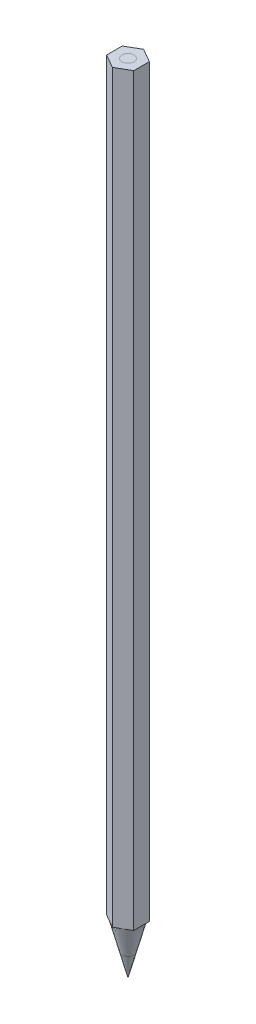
ISO-10303-21;
HEADER;
FILE_DESCRIPTION(('STEP AP214'),'2;1');
FILE_NAME('part.step','',(''),(''),'','','');
FILE_SCHEMA(('AUTOMOTIVE_DESIGN { 1 0 10303 214 1 1 1 1 }'));
ENDSEC;
DATA;
#1=APPLICATION_CONTEXT('core data for automotive mechanical design processes');
#2=APPLICATION_PROTOCOL_DEFINITION('international standard','automotive_design',2000,#1);
#3=PRODUCT_CONTEXT('',#1,'mechanical');
#4=PRODUCT('Part','Part','',(#3));
#5=PRODUCT_RELATED_PRODUCT_CATEGORY('part','',(#4));
#6=PRODUCT_DEFINITION_FORMATION('','',#4);
#7=PRODUCT_DEFINITION_CONTEXT('part definition',#1,'design');
#8=PRODUCT_DEFINITION('design','',#6,#7);
#9=PRODUCT_DEFINITION_SHAPE('','',#8);
#10=(LENGTH_UNIT() NAMED_UNIT(*) SI_UNIT(.MILLI.,.METRE.));
#11=(NAMED_UNIT(*) PLANE_ANGLE_UNIT() SI_UNIT($,.RADIAN.));
#12=(NAMED_UNIT(*) SI_UNIT($,.STERADIAN.) SOLID_ANGLE_UNIT());
#13=UNCERTAINTY_MEASURE_WITH_UNIT(LENGTH_MEASURE(1.E-05),#10,'distance_accuracy_value','');
#14=(GEOMETRIC_REPRESENTATION_CONTEXT(3) GLOBAL_UNCERTAINTY_ASSIGNED_CONTEXT((#13)) GLOBAL_UNIT_ASSIGNED_CONTEXT((#10,
#11,#12)) REPRESENTATION_CONTEXT('',''));
#15=CARTESIAN_POINT('',(0.,0.,0.));
#16=DIRECTION('',(0.,0.,1.));
#17=DIRECTION('',(1.,0.,0.));
#18=AXIS2_PLACEMENT_3D('',#15,#16,#17);
#19=CARTESIAN_POINT('',(0.,200.,0.));
#20=DIRECTION('',(0.,-1.,0.));
#21=DIRECTION('',(0.,0.,-1.));
#22=AXIS2_PLACEMENT_3D('',#19,#20,#21);
#23=CYLINDRICAL_SURFACE('',#22,1.5);
#24=CARTESIAN_POINT('',(0.,5.7389647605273,0.));
#25=DIRECTION('',(0.,1.,0.));
#26=DIRECTION('',(0.,0.,1.));
#27=AXIS2_PLACEMENT_3D('',#24,#25,#26);
#28=CIRCLE('',#27,1.5);
#29=CARTESIAN_POINT('',(0.,5.7389647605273,1.5));
#30=VERTEX_POINT('',#29);
#31=EDGE_CURVE('E44',#30,#30,#28,.T.);
#32=ORIENTED_EDGE('',*,*,#31,.T.);
#33=EDGE_LOOP('',(#32));
#34=FACE_BOUND('',#33,.T.);
#35=CARTESIAN_POINT('',(0.,200.,0.));
#36=DIRECTION('',(0.,1.,0.));
#37=DIRECTION('',(0.,0.,1.));
#38=AXIS2_PLACEMENT_3D('',#35,#36,#37);
#39=CIRCLE('',#38,1.5);
#40=CARTESIAN_POINT('',(0.,200.,1.5));
#41=VERTEX_POINT('',#40);
#42=EDGE_CURVE('E12',#41,#41,#39,.T.);
#43=ORIENTED_EDGE('',*,*,#42,.F.);
#44=EDGE_LOOP('',(#43));
#45=FACE_BOUND('',#44,.T.);
#46=ADVANCED_FACE('F41',(#34,#45),#23,.T.);
#47=CARTESIAN_POINT('',(0.,200.,0.));
#48=DIRECTION('',(0.,1.,0.));
#49=DIRECTION('',(0.,0.,1.));
#50=AXIS2_PLACEMENT_3D('',#47,#48,#49);
#51=PLANE('',#50);
#52=ORIENTED_EDGE('',*,*,#42,.T.);
#53=EDGE_LOOP('',(#52));
#54=FACE_BOUND('',#53,.T.);
#55=ADVANCED_FACE('F53',(#54),#51,.T.);
#56=CARTESIAN_POINT('',(0.,13.0083201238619,0.));
#57=DIRECTION('',(0.,1.,0.));
#58=DIRECTION('',(0.,0.,1.));
#59=AXIS2_PLACEMENT_3D('',#56,#57,#58);
#60=CONICAL_SURFACE('',#59,3.4,0.255651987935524);
#61=CARTESIAN_POINT('',(0.,0.,0.));
#62=VERTEX_POINT('',#61);
#63=VERTEX_LOOP('',#62);
#64=FACE_BOUND('',#63,.T.);
#65=ORIENTED_EDGE('',*,*,#31,.F.);
#66=EDGE_LOOP('',(#65));
#67=FACE_BOUND('',#66,.T.);
#68=ADVANCED_FACE('F50',(#64,#67),#60,.T.);
#69=CLOSED_SHELL('',(#46,#55,#68));
#70=MANIFOLD_SOLID_BREP('B2',#69);
#71=CARTESIAN_POINT('',(0.,200.,-3.92598183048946));
#72=DIRECTION('',(0.,1.,0.));
#73=DIRECTION('',(0.,0.,1.));
#74=AXIS2_PLACEMENT_3D('',#71,#72,#73);
#75=PLANE('',#74);
#76=DIRECTION('',(-0.866025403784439,0.,-0.5));
#77=VECTOR('',#76,1.);
#78=CARTESIAN_POINT('',(3.4,200.,-1.96299091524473));
#79=LINE('',#78,#77);
#80=CARTESIAN_POINT('',(3.4,200.,-1.96299091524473));
#81=VERTEX_POINT('',#80);
#82=CARTESIAN_POINT('',(0.,200.,-3.92598183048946));
#83=VERTEX_POINT('',#82);
#84=EDGE_CURVE('E186',#81,#83,#79,.T.);
#85=ORIENTED_EDGE('',*,*,#84,.T.);
#86=DIRECTION('',(-0.866025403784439,0.,0.5));
#87=VECTOR('',#86,1.);
#88=CARTESIAN_POINT('',(0.,200.,-3.92598183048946));
#89=LINE('',#88,#87);
#90=CARTESIAN_POINT('',(-3.4,200.,-1.96299091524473));
#91=VERTEX_POINT('',#90);
#92=EDGE_CURVE('E193',#83,#91,#89,.T.);
#93=ORIENTED_EDGE('',*,*,#92,.T.);
#94=DIRECTION('',(0.,0.,1.));
#95=VECTOR('',#94,1.);
#96=CARTESIAN_POINT('',(-3.4,200.,-1.96299091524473));
#97=LINE('',#96,#95);
#98=CARTESIAN_POINT('',(-3.4,200.,1.96299091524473));
#99=VERTEX_POINT('',#98);
#100=EDGE_CURVE('E195',#91,#99,#97,.T.);
#101=ORIENTED_EDGE('',*,*,#100,.T.);
#102=DIRECTION('',(0.866025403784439,0.,0.5));
#103=VECTOR('',#102,1.);
#104=CARTESIAN_POINT('',(-3.4,200.,1.96299091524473));
#105=LINE('',#104,#103);
#106=CARTESIAN_POINT('',(0.,200.,3.92598183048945));
#107=VERTEX_POINT('',#106);
#108=EDGE_CURVE('E197',#99,#107,#105,.T.);
#109=ORIENTED_EDGE('',*,*,#108,.T.);
#110=DIRECTION('',(0.866025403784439,0.,-0.499999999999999));
#111=VECTOR('',#110,1.);
#112=CARTESIAN_POINT('',(0.,200.,3.92598183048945));
#113=LINE('',#112,#111);
#114=CARTESIAN_POINT('',(3.4,200.,1.96299091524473));
#115=VERTEX_POINT('',#114);
#116=EDGE_CURVE('E199',#107,#115,#113,.T.);
#117=ORIENTED_EDGE('',*,*,#116,.T.);
#118=DIRECTION('',(0.,0.,-1.));
#119=VECTOR('',#118,1.);
#120=CARTESIAN_POINT('',(3.4,200.,1.96299091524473));
#121=LINE('',#120,#119);
#122=EDGE_CURVE('E107',#115,#81,#121,.T.);
#123=ORIENTED_EDGE('',*,*,#122,.T.);
#124=EDGE_LOOP('',(#85,#93,#101,#109,#117,#123));
#125=FACE_BOUND('',#124,.T.);
#126=CARTESIAN_POINT('',(0.,200.,0.));
#127=DIRECTION('',(0.,1.,0.));
#128=DIRECTION('',(0.,0.,1.));
#129=AXIS2_PLACEMENT_3D('',#126,#127,#128);
#130=CIRCLE('',#129,1.5);
#131=CARTESIAN_POINT('',(0.,200.,1.5));
#132=VERTEX_POINT('',#131);
#133=EDGE_CURVE('E184',#132,#132,#130,.T.);
#134=ORIENTED_EDGE('',*,*,#133,.F.);
#135=EDGE_LOOP('',(#134));
#136=FACE_BOUND('',#135,.T.);
#137=ADVANCED_FACE('F84',(#125,#136),#75,.T.);
#138=CARTESIAN_POINT('',(3.4,200.,-1.96299091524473));
#139=DIRECTION('',(-0.5,0.,0.866025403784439));
#140=DIRECTION('',(0.866025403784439,0.,0.5));
#141=AXIS2_PLACEMENT_3D('',#138,#139,#140);
#142=PLANE('',#141);
#143=DIRECTION('',(0.,-1.,0.));
#144=VECTOR('',#143,1.);
#145=CARTESIAN_POINT('',(3.4,200.,-1.96299091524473));
#146=LINE('',#145,#144);
#147=CARTESIAN_POINT('',(3.4,13.0083201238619,-1.96299091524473));
#148=VERTEX_POINT('',#147);
#149=EDGE_CURVE('E183',#81,#148,#146,.T.);
#150=ORIENTED_EDGE('',*,*,#149,.T.);
#151=DIRECTION('',(-0.866025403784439,0.,-0.5));
#152=VECTOR('',#151,1.);
#153=CARTESIAN_POINT('',(3.4,13.0083201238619,-1.96299091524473));
#154=LINE('',#153,#152);
#155=CARTESIAN_POINT('',(1.7,13.0083201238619,-2.94448637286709));
#156=VERTEX_POINT('',#155);
#157=EDGE_CURVE('E99',#148,#156,#154,.T.);
#158=ORIENTED_EDGE('',*,*,#157,.T.);
#159=CARTESIAN_POINT('',(0.,13.0083201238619,-3.92598183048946));
#160=VERTEX_POINT('',#159);
#161=EDGE_CURVE('E157',#156,#160,#154,.T.);
#162=ORIENTED_EDGE('',*,*,#161,.T.);
#163=DIRECTION('',(0.,-1.,0.));
#164=VECTOR('',#163,1.);
#165=CARTESIAN_POINT('',(0.,200.,-3.92598183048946));
#166=LINE('',#165,#164);
#167=EDGE_CURVE('E215',#83,#160,#166,.T.);
#168=ORIENTED_EDGE('',*,*,#167,.F.);
#169=ORIENTED_EDGE('',*,*,#84,.F.);
#170=EDGE_LOOP('',(#150,#158,#162,#168,#169));
#171=FACE_BOUND('',#170,.T.);
#172=ADVANCED_FACE('F86',(#171),#142,.F.);
#173=CARTESIAN_POINT('',(0.,200.,-3.92598183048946));
#174=DIRECTION('',(0.5,0.,0.866025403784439));
#175=DIRECTION('',(0.866025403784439,0.,-0.5));
#176=AXIS2_PLACEMENT_3D('',#173,#174,#175);
#177=PLANE('',#176);
#178=ORIENTED_EDGE('',*,*,#167,.T.);
#179=DIRECTION('',(-0.866025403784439,0.,0.5));
#180=VECTOR('',#179,1.);
#181=CARTESIAN_POINT('',(0.,13.0083201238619,-3.92598183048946));
#182=LINE('',#181,#180);
#183=CARTESIAN_POINT('',(-1.7,13.0083201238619,-2.94448637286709));
#184=VERTEX_POINT('',#183);
#185=EDGE_CURVE('E163',#160,#184,#182,.T.);
#186=ORIENTED_EDGE('',*,*,#185,.T.);
#187=CARTESIAN_POINT('',(-3.4,13.0083201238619,-1.96299091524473));
#188=VERTEX_POINT('',#187);
#189=EDGE_CURVE('E189',#184,#188,#182,.T.);
#190=ORIENTED_EDGE('',*,*,#189,.T.);
#191=DIRECTION('',(0.,-1.,0.));
#192=VECTOR('',#191,1.);
#193=CARTESIAN_POINT('',(-3.4,200.,-1.96299091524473));
#194=LINE('',#193,#192);
#195=EDGE_CURVE('E212',#91,#188,#194,.T.);
#196=ORIENTED_EDGE('',*,*,#195,.F.);
#197=ORIENTED_EDGE('',*,*,#92,.F.);
#198=EDGE_LOOP('',(#178,#186,#190,#196,#197));
#199=FACE_BOUND('',#198,.T.);
#200=ADVANCED_FACE('F257',(#199),#177,.F.);
#201=CARTESIAN_POINT('',(-3.4,200.,-1.96299091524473));
#202=DIRECTION('',(1.,0.,0.));
#203=DIRECTION('',(0.,0.,-1.));
#204=AXIS2_PLACEMENT_3D('',#201,#202,#203);
#205=PLANE('',#204);
#206=ORIENTED_EDGE('',*,*,#195,.T.);
#207=DIRECTION('',(0.,0.,1.));
#208=VECTOR('',#207,1.);
#209=CARTESIAN_POINT('',(-3.4,13.0083201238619,-1.96299091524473));
#210=LINE('',#209,#208);
#211=CARTESIAN_POINT('',(-3.4,13.0083201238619,0.));
#212=VERTEX_POINT('',#211);
#213=EDGE_CURVE('E232',#188,#212,#210,.T.);
#214=ORIENTED_EDGE('',*,*,#213,.T.);
#215=CARTESIAN_POINT('',(-3.4,13.0083201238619,1.96299091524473));
#216=VERTEX_POINT('',#215);
#217=EDGE_CURVE('E230',#212,#216,#210,.T.);
#218=ORIENTED_EDGE('',*,*,#217,.T.);
#219=DIRECTION('',(0.,-1.,0.));
#220=VECTOR('',#219,1.);
#221=CARTESIAN_POINT('',(-3.4,200.,1.96299091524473));
#222=LINE('',#221,#220);
#223=EDGE_CURVE('E209',#99,#216,#222,.T.);
#224=ORIENTED_EDGE('',*,*,#223,.F.);
#225=ORIENTED_EDGE('',*,*,#100,.F.);
#226=EDGE_LOOP('',(#206,#214,#218,#224,#225));
#227=FACE_BOUND('',#226,.T.);
#228=ADVANCED_FACE('F255',(#227),#205,.F.);
#229=CARTESIAN_POINT('',(-3.4,200.,1.96299091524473));
#230=DIRECTION('',(0.5,0.,-0.866025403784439));
#231=DIRECTION('',(-0.866025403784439,0.,-0.5));
#232=AXIS2_PLACEMENT_3D('',#229,#230,#231);
#233=PLANE('',#232);
#234=ORIENTED_EDGE('',*,*,#223,.T.);
#235=DIRECTION('',(0.866025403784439,0.,0.5));
#236=VECTOR('',#235,1.);
#237=CARTESIAN_POINT('',(-3.4,13.0083201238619,1.96299091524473));
#238=LINE('',#237,#236);
#239=CARTESIAN_POINT('',(-1.7,13.0083201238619,2.94448637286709));
#240=VERTEX_POINT('',#239);
#241=EDGE_CURVE('E229',#216,#240,#238,.T.);
#242=ORIENTED_EDGE('',*,*,#241,.T.);
#243=CARTESIAN_POINT('',(0.,13.0083201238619,3.92598183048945));
#244=VERTEX_POINT('',#243);
#245=EDGE_CURVE('E226',#240,#244,#238,.T.);
#246=ORIENTED_EDGE('',*,*,#245,.T.);
#247=DIRECTION('',(0.,-1.,0.));
#248=VECTOR('',#247,1.);
#249=CARTESIAN_POINT('',(0.,200.,3.92598183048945));
#250=LINE('',#249,#248);
#251=EDGE_CURVE('E206',#107,#244,#250,.T.);
#252=ORIENTED_EDGE('',*,*,#251,.F.);
#253=ORIENTED_EDGE('',*,*,#108,.F.);
#254=EDGE_LOOP('',(#234,#242,#246,#252,#253));
#255=FACE_BOUND('',#254,.T.);
#256=ADVANCED_FACE('F238',(#255),#233,.F.);
#257=CARTESIAN_POINT('',(0.,200.,3.92598183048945));
#258=DIRECTION('',(-0.499999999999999,0.,-0.866025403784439));
#259=DIRECTION('',(-0.866025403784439,0.,0.5));
#260=AXIS2_PLACEMENT_3D('',#257,#258,#259);
#261=PLANE('',#260);
#262=ORIENTED_EDGE('',*,*,#251,.T.);
#263=DIRECTION('',(0.866025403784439,0.,-0.5));
#264=VECTOR('',#263,1.);
#265=CARTESIAN_POINT('',(0.,13.0083201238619,3.92598183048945));
#266=LINE('',#265,#264);
#267=CARTESIAN_POINT('',(1.7,13.0083201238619,2.94448637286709));
#268=VERTEX_POINT('',#267);
#269=EDGE_CURVE('E221',#244,#268,#266,.T.);
#270=ORIENTED_EDGE('',*,*,#269,.T.);
#271=CARTESIAN_POINT('',(3.4,13.0083201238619,1.96299091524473));
#272=VERTEX_POINT('',#271);
#273=EDGE_CURVE('E217',#268,#272,#266,.T.);
#274=ORIENTED_EDGE('',*,*,#273,.T.);
#275=DIRECTION('',(0.,-1.,0.));
#276=VECTOR('',#275,1.);
#277=CARTESIAN_POINT('',(3.4,200.,1.96299091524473));
#278=LINE('',#277,#276);
#279=EDGE_CURVE('E203',#115,#272,#278,.T.);
#280=ORIENTED_EDGE('',*,*,#279,.F.);
#281=ORIENTED_EDGE('',*,*,#116,.F.);
#282=EDGE_LOOP('',(#262,#270,#274,#280,#281));
#283=FACE_BOUND('',#282,.T.);
#284=ADVANCED_FACE('F250',(#283),#261,.F.);
#285=CARTESIAN_POINT('',(3.4,200.,1.96299091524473));
#286=DIRECTION('',(-1.,0.,0.));
#287=DIRECTION('',(0.,0.,1.));
#288=AXIS2_PLACEMENT_3D('',#285,#286,#287);
#289=PLANE('',#288);
#290=ORIENTED_EDGE('',*,*,#279,.T.);
#291=DIRECTION('',(0.,0.,-1.));
#292=VECTOR('',#291,1.);
#293=CARTESIAN_POINT('',(3.4,13.0083201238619,1.96299091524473));
#294=LINE('',#293,#292);
#295=CARTESIAN_POINT('',(3.4,13.0083201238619,0.));
#296=VERTEX_POINT('',#295);
#297=EDGE_CURVE('E39',#272,#296,#294,.T.);
#298=ORIENTED_EDGE('',*,*,#297,.T.);
#299=EDGE_CURVE('E88',#296,#148,#294,.T.);
#300=ORIENTED_EDGE('',*,*,#299,.T.);
#301=ORIENTED_EDGE('',*,*,#149,.F.);
#302=ORIENTED_EDGE('',*,*,#122,.F.);
#303=EDGE_LOOP('',(#290,#298,#300,#301,#302));
#304=FACE_BOUND('',#303,.T.);
#305=ADVANCED_FACE('F274',(#304),#289,.F.);
#306=CARTESIAN_POINT('',(0.,200.,0.));
#307=DIRECTION('',(0.,-1.,0.));
#308=DIRECTION('',(0.,0.,-1.));
#309=AXIS2_PLACEMENT_3D('',#306,#307,#308);
#310=CYLINDRICAL_SURFACE('',#309,1.5);
#311=CARTESIAN_POINT('',(0.,5.7389647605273,0.));
#312=DIRECTION('',(0.,1.,0.));
#313=DIRECTION('',(0.,0.,1.));
#314=AXIS2_PLACEMENT_3D('',#311,#312,#313);
#315=CIRCLE('',#314,1.5);
#316=CARTESIAN_POINT('',(0.,5.7389647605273,1.5));
#317=VERTEX_POINT('',#316);
#318=EDGE_CURVE('E179',#317,#317,#315,.T.);
#319=ORIENTED_EDGE('',*,*,#318,.F.);
#320=EDGE_LOOP('',(#319));
#321=FACE_BOUND('',#320,.T.);
#322=ORIENTED_EDGE('',*,*,#133,.T.);
#323=EDGE_LOOP('',(#322));
#324=FACE_BOUND('',#323,.T.);
#325=ADVANCED_FACE('F272',(#321,#324),#310,.F.);
#326=CARTESIAN_POINT('',(3.4,13.0083201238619,0.));
#327=DIRECTION('',(0.,1.,0.));
#328=DIRECTION('',(0.,0.,1.));
#329=AXIS2_PLACEMENT_3D('',#326,#327,#328);
#330=PLANE('',#329);
#331=ORIENTED_EDGE('',*,*,#299,.F.);
#332=CARTESIAN_POINT('',(0.,13.0083201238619,0.));
#333=DIRECTION('',(0.,-1.,0.));
#334=DIRECTION('',(0.,0.,-1.));
#335=AXIS2_PLACEMENT_3D('',#332,#333,#334);
#336=CIRCLE('',#335,3.4);
#337=EDGE_CURVE('E172',#156,#296,#336,.T.);
#338=ORIENTED_EDGE('',*,*,#337,.F.);
#339=ORIENTED_EDGE('',*,*,#157,.F.);
#340=EDGE_LOOP('',(#331,#338,#339));
#341=FACE_BOUND('',#340,.T.);
#342=ADVANCED_FACE('F177',(#341),#330,.F.);
#343=EDGE_CURVE('E160',#184,#156,#336,.T.);
#344=ORIENTED_EDGE('',*,*,#343,.F.);
#345=ORIENTED_EDGE('',*,*,#185,.F.);
#346=ORIENTED_EDGE('',*,*,#161,.F.);
#347=EDGE_LOOP('',(#344,#345,#346));
#348=FACE_BOUND('',#347,.T.);
#349=ADVANCED_FACE('F159',(#348),#330,.F.);
#350=EDGE_CURVE('E175',#212,#184,#336,.T.);
#351=ORIENTED_EDGE('',*,*,#350,.F.);
#352=ORIENTED_EDGE('',*,*,#213,.F.);
#353=ORIENTED_EDGE('',*,*,#189,.F.);
#354=EDGE_LOOP('',(#351,#352,#353));
#355=FACE_BOUND('',#354,.T.);
#356=ADVANCED_FACE('F306',(#355),#330,.F.);
#357=EDGE_CURVE('E244',#240,#212,#336,.T.);
#358=ORIENTED_EDGE('',*,*,#357,.F.);
#359=ORIENTED_EDGE('',*,*,#241,.F.);
#360=ORIENTED_EDGE('',*,*,#217,.F.);
#361=EDGE_LOOP('',(#358,#359,#360));
#362=FACE_BOUND('',#361,.T.);
#363=ADVANCED_FACE('F243',(#362),#330,.F.);
#364=EDGE_CURVE('E246',#268,#240,#336,.T.);
#365=ORIENTED_EDGE('',*,*,#364,.F.);
#366=ORIENTED_EDGE('',*,*,#269,.F.);
#367=ORIENTED_EDGE('',*,*,#245,.F.);
#368=EDGE_LOOP('',(#365,#366,#367));
#369=FACE_BOUND('',#368,.T.);
#370=ADVANCED_FACE('F249',(#369),#330,.F.);
#371=EDGE_CURVE('E180',#296,#268,#336,.T.);
#372=ORIENTED_EDGE('',*,*,#371,.F.);
#373=ORIENTED_EDGE('',*,*,#297,.F.);
#374=ORIENTED_EDGE('',*,*,#273,.F.);
#375=EDGE_LOOP('',(#372,#373,#374));
#376=FACE_BOUND('',#375,.T.);
#377=ADVANCED_FACE('F300',(#376),#330,.F.);
#378=CARTESIAN_POINT('',(0.,13.0083201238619,0.));
#379=DIRECTION('',(0.,1.,0.));
#380=DIRECTION('',(0.,0.,1.));
#381=AXIS2_PLACEMENT_3D('',#378,#379,#380);
#382=CONICAL_SURFACE('',#381,3.4,0.255651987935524);
#383=ORIENTED_EDGE('',*,*,#318,.T.);
#384=EDGE_LOOP('',(#383));
#385=FACE_BOUND('',#384,.T.);
#386=ORIENTED_EDGE('',*,*,#337,.T.);
#387=ORIENTED_EDGE('',*,*,#371,.T.);
#388=ORIENTED_EDGE('',*,*,#364,.T.);
#389=ORIENTED_EDGE('',*,*,#357,.T.);
#390=ORIENTED_EDGE('',*,*,#350,.T.);
#391=ORIENTED_EDGE('',*,*,#343,.T.);
#392=EDGE_LOOP('',(#386,#387,#388,#389,#390,#391));
#393=FACE_BOUND('',#392,.T.);
#394=ADVANCED_FACE('F170',(#385,#393),#382,.T.);
#395=CLOSED_SHELL('',(#137,#172,#200,#228,#256,#284,#305,#325,#342,#349,#356,#363,#370,#377,#394));
#396=MANIFOLD_SOLID_BREP('B6',#395);
#397=ADVANCED_BREP_SHAPE_REPRESENTATION('',(#18,#70,#396),#14);
#398=SHAPE_DEFINITION_REPRESENTATION(#9,#397);
ENDSEC;
END-ISO-10303-21;
